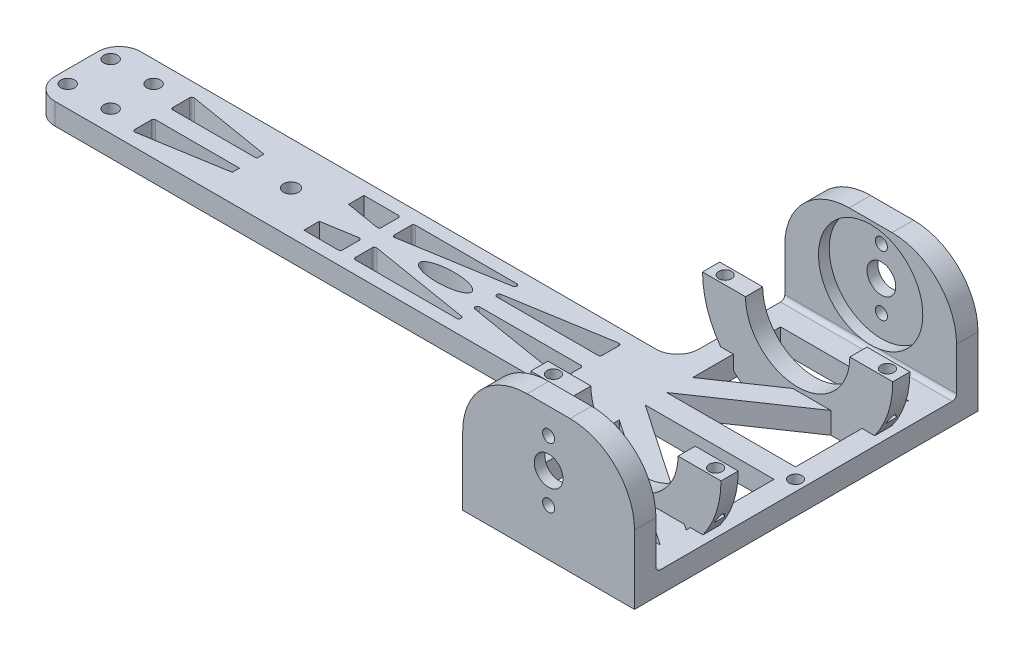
from build123d import *

# Parameters (mm, degrees)
MAIN_CHASSIS_EXTRUDE_DEPTH                  = 5
FILLET1_R                                   = 5
SKETCH3_W                                   = 40
SKETCH3_H                                   = 26
SKETCH3_R                                   = 1.4
SKETCH3_R_2                                 = 3.35
MOTOR_BRACE_EXTRUSION_DEPTH                 = 5
FILLET2_R                                   = 1
MOTOR_PROFILE_IN_BRACE_EXTRUSION_DEPTH      = 1
MOTOR_PROFILE_IN_BRACE_EXTRUSION_DEPTH_BACK = 2.5
SKETCH4_R                                   = 12.15
SKELTONISING_CHASSIS_DEPTH                  = 139.477434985
MOTOR_CLAMP_DEPTH                           = 2
SKETCH14_R                                  = 1.5
CUT_EXTRUDE7_DEPTH                          = 10
FILLET3_R                                   = 0.5
FILLET4_R                                   = 15
SKETCH2_R                                   = 1.6
FRONT_PCB_MOUNTING_HOLES_DEPTH              = 139.477434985
SKETCH8_RX                                  = 6
SKETCH8_RY                                  = 2
CUT_EXTRUDE5_DEPTH                          = 139.477434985
SKETCH9_W                                   = 20
SKETCH9_H                                   = 20
BOSS_EXTRUDE4_DEPTH                         = 5
CUT_EXTRUDE6_DEPTH                          = 139.477435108
CUT_EXTRUDE6_DEPTH_BACK                     = 139.477435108
SKETCH11_R                                  = 1.75
SKETCH11_R_2                                = 1.5
CUT_EXTRUDE8_DEPTH                          = 178.37248953
CUT_EXTRUDE8_DEPTH_BACK                     = 178.37248953
SKETCH15_W                                  = 80
SKETCH15_H                                  = 10


with BuildPart() as part:
    # Sketch1 → Main Chassis Extrude (new body)
    with BuildSketch(Plane(origin=(0, 0, 0), x_dir=(1, 0, 0), z_dir=(0, 1, 0))):
        Polygon((0, -10), (-130, -10), (-130, 0), (40, 0), (40, -40), (0, -40), align=None)
    extrude(amount=MAIN_CHASSIS_EXTRUDE_DEPTH)

    # Fillet1
    fillet1_edges = [part.edges().sort_by_distance(p)[0] for p in [
        (0, 2.5, 10),
        (-130, 2.5, 10),
    ]]
    fillet(fillet1_edges, radius=FILLET1_R)

    # Sketch3 → Motor Brace Extrusion (add)
    with BuildSketch(Plane.XY.offset(40)):
        with Locations((20, 18)):
            Rectangle(SKETCH3_W, SKETCH3_H)
        with Locations((20, 25)):
            Circle(SKETCH3_R, mode=Mode.SUBTRACT)
        with Locations((20, 11)):
            Circle(SKETCH3_R, mode=Mode.SUBTRACT)
        with Locations((20, 18)):
            Circle(SKETCH3_R_2, mode=Mode.SUBTRACT)
    extrude(amount=-MOTOR_BRACE_EXTRUSION_DEPTH)

    # Fillet2
    fillet2_edges = [part.edges().sort_by_distance(p)[0] for p in [
        (20, 5, 35),
    ]]
    fillet(fillet2_edges, radius=FILLET2_R)

    # Sketch4 → Motor Profile in brace extrusion (cut, two sides: drawn at the far end of the back side and taken through both)
    with BuildSketch(Plane(origin=(0, 0, 35), x_dir=(-1, 0, 0), z_dir=(0, 0, -1)).offset(-MOTOR_PROFILE_IN_BRACE_EXTRUSION_DEPTH_BACK)):
        with Locations(Location((-20, 18, 0), (0, 0, 260.987548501))):
            Circle(SKETCH4_R)
    extrude(amount=MOTOR_PROFILE_IN_BRACE_EXTRUSION_DEPTH + MOTOR_PROFILE_IN_BRACE_EXTRUSION_DEPTH_BACK, mode=Mode.SUBTRACT)

    # Sketch5 → Skeltonising Chassis (cut, through all)
    with BuildSketch(Plane(origin=(0, 5, 0), x_dir=(1, 0, 0), z_dir=(0, 1, 0))):
        Polygon((5, -2.5), (35, -2.5), (35, -22.948924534), align=None)
        Polygon((5, -8.551075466), (35, -29), (5, -29), align=None)
        Polygon((-110, -7), (-79.841877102, -2), (-110, -2), align=None)
        Polygon((-91.658122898, -7), (-61.5, -2), (-61.5, -7), align=None)
        Polygon((-58.5, -2), (-58.5, -7), (-28.341877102, -7), align=None)
        Polygon((-40.158122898, -2), (-10, -7), (-10, -2), align=None)
    extrude(amount=-SKELTONISING_CHASSIS_DEPTH, mode=Mode.SUBTRACT)

    # Sketch13 → Motor Clamp (add, symmetric)
    with BuildSketch(Plane.XY.offset(20)):
        with BuildLine():
            Line((42.15, 18), (32.15, 18))
            ThreePointArc((32.15, 18), (20, 5.85), (7.85, 18))
            Line((7.85, 18), (-2.15, 18))
            ThreePointArc((-2.15, 18), (20, -4.15), (42.15, 18))
        make_face()
    extrude(amount=MOTOR_CLAMP_DEPTH, both=True)

    # Sketch14 → Cut-Extrude7 (cut)
    with BuildSketch(Plane(origin=(0, 18, 0), x_dir=(1, 0, 0), z_dir=(0, 1, 0))):
        with Locations(Location((1.1, -20, 0), (0, 0, 180))):
            Circle(SKETCH14_R)
        with Locations(Location((38.9, -20, 0), (0, 0, 180))):
            Circle(SKETCH14_R)
    extrude(amount=-CUT_EXTRUDE7_DEPTH, mode=Mode.SUBTRACT)

    # Fillet3
    fillet3_edges = [part.edges().sort_by_distance(p)[0] for p in [
        (-110, 2.5, 7),
        (-110, 2.5, 2),
        (-79.841877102, 2.5, 2),
        (-40.158122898, 2.5, 2),
        (-10, 2.5, 2),
        (-10, 2.5, 7),
        (-58.5, 2.5, 2),
        (-28.341877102, 2.5, 7),
        (-58.5, 2.5, 7),
        (-61.5, 2.5, 7),
        (-91.658122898, 2.5, 7),
        (-61.5, 2.5, 2),
    ]]
    fillet(fillet3_edges, radius=FILLET3_R)

    # Fillet4
    fillet4_edges = [part.edges().sort_by_distance(p)[0] for p in [
        (40, 31, 37.5),
        (0, 31, 37.5),
    ]]
    fillet(fillet4_edges, radius=FILLET4_R)

    # Mirror1: part across plane


with BuildPart() as part_1:
    add(part.part)
    add(part.part.mirror(Plane.XY))

    # Sketch2 → Front PCB Mounting Holes (cut, through all)
    with BuildSketch(Plane(origin=(0, 5, 0), x_dir=(1, 0, 0), z_dir=(0, 1, 0))):
        with Locations(Location((-127, 5, 0), (0, 0, 270))):
            Circle(SKETCH2_R)
        with Locations(Location((-117, 5, 0), (0, 0, 270))):
            Circle(SKETCH2_R)
        with Locations(Location((-117, -5, 0), (0, 0, 270))):
            Circle(SKETCH2_R)
        with Locations(Location((-127, -5, 0), (0, 0, 270))):
            Circle(SKETCH2_R)
    extrude(amount=-FRONT_PCB_MOUNTING_HOLES_DEPTH, mode=Mode.SUBTRACT)

    # Sketch8 → Cut-Extrude5 (cut, through all)
    with BuildSketch(Plane(origin=(0, 5, 0), x_dir=(1, 0, 0), z_dir=(0, 1, 0))):
        with Locations(Location((-76, 0), (0, 0, 180))):
            Ellipse(SKETCH8_RX, SKETCH8_RY)
        with Locations((-44, 0)):
            Ellipse(SKETCH8_RX, SKETCH8_RY)
    extrude(amount=-CUT_EXTRUDE5_DEPTH, mode=Mode.SUBTRACT)

    # Sketch9 → Boss-Extrude4 (add)
    with BuildSketch(Plane.XZ):
        with Locations((-80, 0)):
            Rectangle(SKETCH9_W, SKETCH9_H)
    extrude(amount=-BOSS_EXTRUDE4_DEPTH)

    # Sketch11 → Cut-Extrude6 (cut, two sides: drawn at the far end of the back side and taken through both)
    with BuildSketch(Plane(origin=(0, 5, 0), x_dir=(1, 0, 0), z_dir=(0, 1, 0)).offset(-CUT_EXTRUDE6_DEPTH_BACK)):
        with Locations(Location((-80, 0, 0), (0, 0, 90))):
            Circle(SKETCH11_R)
        with Locations(Location((37.5, 0, 0), (0, 0, 90))):
            Circle(SKETCH11_R_2)
    extrude(amount=CUT_EXTRUDE6_DEPTH + CUT_EXTRUDE6_DEPTH_BACK, mode=Mode.SUBTRACT)

    # Sketch15 → Cut-Extrude8 (cut, two sides: drawn at the far end of the back side and taken through both)
    with BuildSketch(Plane(origin=(40, 0, 0), x_dir=(0, 0, -1), z_dir=(1, 0, 0)).offset(-CUT_EXTRUDE8_DEPTH_BACK)):
        with Locations((0, -5)):
            Rectangle(SKETCH15_W, SKETCH15_H)
    extrude(amount=CUT_EXTRUDE8_DEPTH + CUT_EXTRUDE8_DEPTH_BACK, mode=Mode.SUBTRACT)


solid = part_1.part
